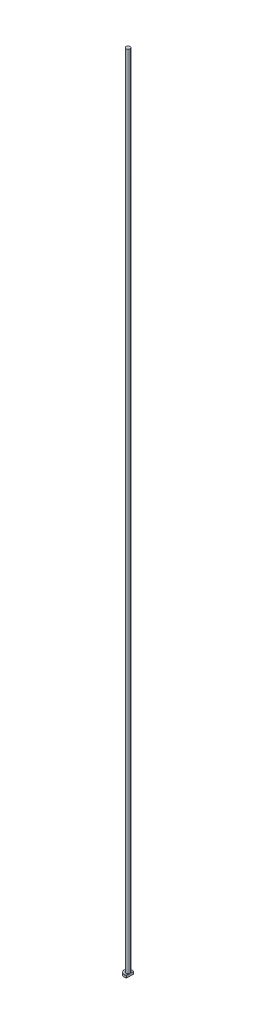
from build123d import *
from build123d.topology import SkipClean

# Parameters (mm, degrees)
CHAMFER1_SIZE = 0.2
FILLET1_R     = 0.2
KEY_DEPTH     = 1001.024999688


with BuildPart() as part:
    # Sketch1 → Revolve1 (revolve)
    with BuildSketch(Plane.XY, mode=Mode.PRIVATE) as revolve1_sk:
        Polygon((0, 0), (-5, 0), (-5, 3), (-2.5, 3), (-2.5, 1000), (0, 1000), align=None)
    revolve(revolve1_sk.sketch.rotate(Axis((0, 259.958771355, 0), (0, -1, 0)), 270), axis=Axis((0, 259.958771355, 0), (0, -1, 0)))

    # Chamfer1
    chamfer1_edges = [part.edges().sort_by_distance(p)[0] for p in [
        (0, 3, -5),
        (0, 0, -5),
    ]]
    chamfer(chamfer1_edges, length=CHAMFER1_SIZE)

    # Fillet1
    fillet1_edges = [part.edges().sort_by_distance(p)[0] for p in [
        (0, 3, -2.5),
    ]]
    fillet(fillet1_edges, radius=FILLET1_R)

    # Sketch2 → KEY (cut, through all)
    with SkipClean():  # the faces are left unmerged after this step: merging them gives an invalid solid
        with BuildSketch(Plane(origin=(0, 0, 0), x_dir=(1, 0, 0), z_dir=(0, 1, 0))):
            with BuildLine():
                Line((2.5, 4.330127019), (2.5, -4.330127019))
                ThreePointArc((2.5, -4.330127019), (5, 0), (2.5, 4.330127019))
            make_face()
        extrude(amount=KEY_DEPTH, mode=Mode.SUBTRACT)


solid = part.part
